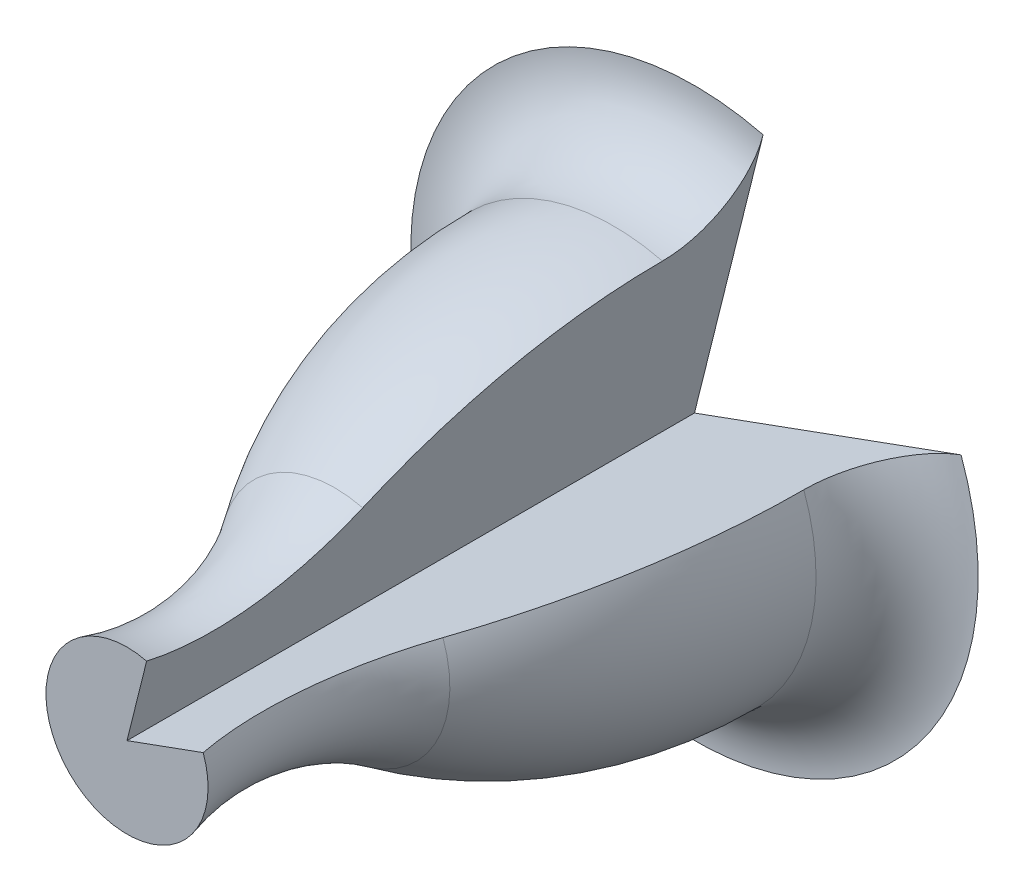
from build123d import *

# Parameters (mm, degrees)
REVOLVE1_ANGLE           = 200
REVOLVE1_OTHER_WAY_ANGLE = 104


with BuildPart() as part:
    # Sketch1 → Revolve1 (revolve)
    with BuildSketch(Plane.XZ):
        with BuildLine():
            Line((0, 0), (-35, 0))
            ThreePointArc((-35, 0), (-27.928932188, 2.928932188), (-25, 10))
            ThreePointArc((-25, 10), (-22.233205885, 28.010001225), (-14.187995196, 44.359003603))
            ThreePointArc((-14.187995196, 44.359003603), (-9.17432045, 56.702625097), (-10, 70))
            Line((-10, 70), (0, 70))
            Line((0, 70), (0, 0))
        make_face()
    revolve(axis=Axis((0, 0, 70), (0, 0, 1)), revolution_arc=REVOLVE1_ANGLE)

    # Sketch1 → Revolve1 other way (revolve)
    with BuildSketch(Plane.XZ):
        with BuildLine():
            Line((0, 0), (-35, 0))
            ThreePointArc((-35, 0), (-27.928932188, 2.928932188), (-25, 10))
            ThreePointArc((-25, 10), (-22.233205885, 28.010001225), (-14.187995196, 44.359003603))
            ThreePointArc((-14.187995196, 44.359003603), (-9.17432045, 56.702625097), (-10, 70))
            Line((-10, 70), (0, 70))
            Line((0, 70), (0, 0))
        make_face()
    revolve(axis=Axis((0, 0, 70), (0, 0, -1)), revolution_arc=REVOLVE1_OTHER_WAY_ANGLE)


solid = part.part
